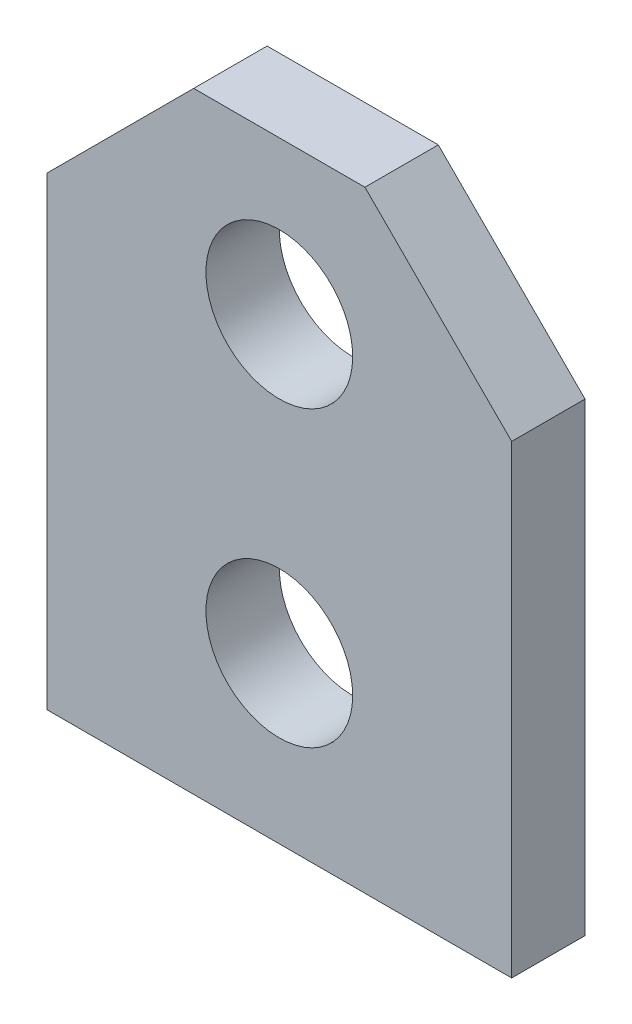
from build123d import *

# Parameters (mm, degrees)
SKETCH1_W     = 9.652
SKETCH1_H     = 12.7
PLATE_DEPTH   = 1.524
SKETCH2_R     = 1.524
HOLES_DEPTH   = 1.524
CHAMFER1_SIZE = 3.048


with BuildPart() as part:
    # Sketch1 → plate (new body)
    with BuildSketch(Plane.XY):
        with Locations((4.826, 6.35)):
            Rectangle(SKETCH1_W, SKETCH1_H)
    extrude(amount=PLATE_DEPTH)

    # Sketch2 → holes (cut)
    with BuildSketch(Plane.XY.offset(1.524)):
        with Locations((4.826, 9.525)):
            Circle(SKETCH2_R)
        with Locations((4.826, 3.429)):
            Circle(SKETCH2_R)
    extrude(amount=-HOLES_DEPTH, mode=Mode.SUBTRACT)

    # Chamfer1
    chamfer1_edges = [part.edges().sort_by_distance(p)[0] for p in [
        (0, 12.7, 0.762),
        (9.652, 12.7, 0.762),
    ]]
    chamfer(chamfer1_edges, length=CHAMFER1_SIZE)


solid = part.part
